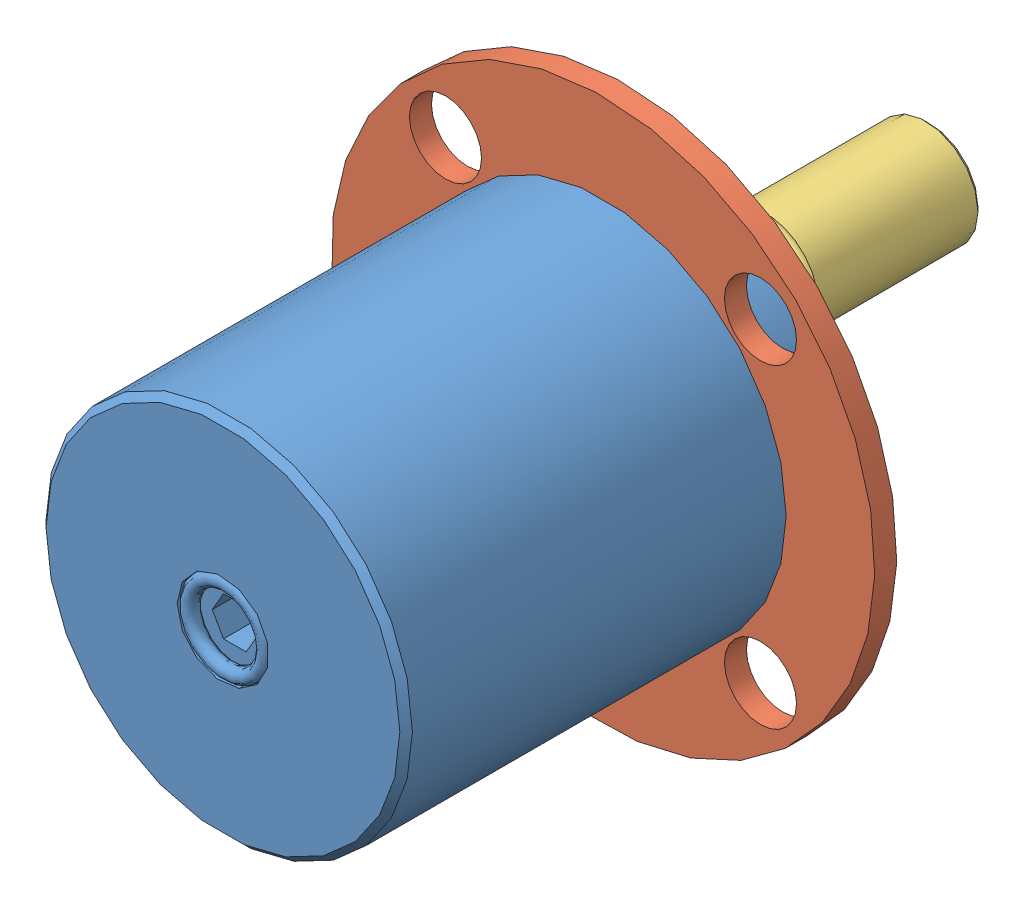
SolidWorks assembly ilc15711000.SLDASM, configuration Default (file format 3400). Lengths in mm.
Overall size (93.18 93.18 85.85).
3 component instances, 3 part files, 5 mates.
Components (placement in the parent):
- ilc15711000_body-1: ilc15711000_body.SLDPRT [Default] at origin size (44.4 44.4 57.35)
- ILC81571007-1: ILC81571007.SLDPRT [Default] at (0 0 -46.0502) x (-0.707107 0.707107 0) z (-0.707107 -0.707107 0) size (65.89 2.67 65.89)
- ilc15711000_pivot-1: ilc15711000_pivot.SLDPRT [Default] at (0 4.445 -43.7388) size (18.64 18.64 41.91)
Mates (geometry in assembly coordinates):
- Coincident1: coincident aligned: circle of ?; plane of ?
- Concentric1: concentric anti-aligned: cylinder of ?; cylinder of ?
- Angle1: planar angle = 0.785398 rad aligned: plane of ?; plane of assembly
- Concentric2: concentric: sphere of ?; sphere of ?
- DELETE ME: concentric anti-aligned: cylinder of ?; cylinder of ?
